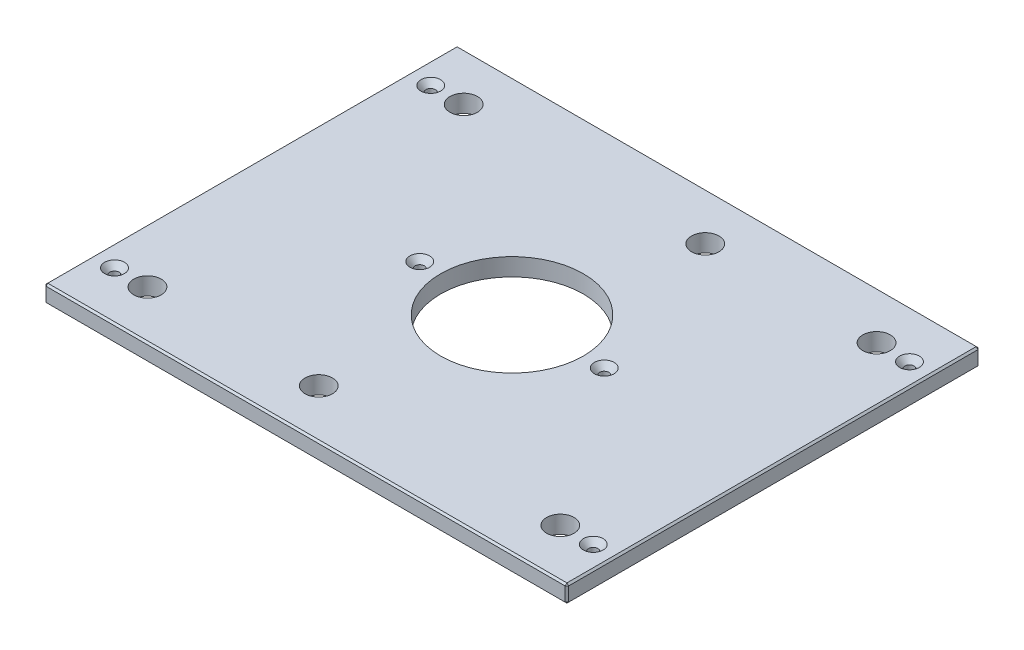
ISO-10303-21;
HEADER;
FILE_DESCRIPTION(('STEP AP214'),'2;1');
FILE_NAME('part.step','',(''),(''),'','','');
FILE_SCHEMA(('AUTOMOTIVE_DESIGN { 1 0 10303 214 1 1 1 1 }'));
ENDSEC;
DATA;
#1=APPLICATION_CONTEXT('core data for automotive mechanical design processes');
#2=APPLICATION_PROTOCOL_DEFINITION('international standard','automotive_design',2000,#1);
#3=PRODUCT_CONTEXT('',#1,'mechanical');
#4=PRODUCT('Part','Part','',(#3));
#5=PRODUCT_RELATED_PRODUCT_CATEGORY('part','',(#4));
#6=PRODUCT_DEFINITION_FORMATION('','',#4);
#7=PRODUCT_DEFINITION_CONTEXT('part definition',#1,'design');
#8=PRODUCT_DEFINITION('design','',#6,#7);
#9=PRODUCT_DEFINITION_SHAPE('','',#8);
#10=(LENGTH_UNIT() NAMED_UNIT(*) SI_UNIT(.MILLI.,.METRE.));
#11=(NAMED_UNIT(*) PLANE_ANGLE_UNIT() SI_UNIT($,.RADIAN.));
#12=(NAMED_UNIT(*) SI_UNIT($,.STERADIAN.) SOLID_ANGLE_UNIT());
#13=UNCERTAINTY_MEASURE_WITH_UNIT(LENGTH_MEASURE(1.E-05),#10,'distance_accuracy_value','');
#14=(GEOMETRIC_REPRESENTATION_CONTEXT(3) GLOBAL_UNCERTAINTY_ASSIGNED_CONTEXT((#13)) GLOBAL_UNIT_ASSIGNED_CONTEXT((#10,
#11,#12)) REPRESENTATION_CONTEXT('',''));
#15=CARTESIAN_POINT('',(0.,0.,0.));
#16=DIRECTION('',(0.,0.,1.));
#17=DIRECTION('',(1.,0.,0.));
#18=AXIS2_PLACEMENT_3D('',#15,#16,#17);
#19=CARTESIAN_POINT('',(-188.9125,12.7,-149.225));
#20=DIRECTION('',(1.,0.,0.));
#21=DIRECTION('',(0.,0.,-1.));
#22=AXIS2_PLACEMENT_3D('',#19,#20,#21);
#23=PLANE('',#22);
#24=DIRECTION('',(0.,0.,-1.));
#25=VECTOR('',#24,1.);
#26=CARTESIAN_POINT('',(-188.9125,11.4299999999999,-149.225));
#27=LINE('',#26,#25);
#28=CARTESIAN_POINT('',(-188.9125,11.4299999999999,147.955));
#29=VERTEX_POINT('',#28);
#30=CARTESIAN_POINT('',(-188.9125,11.4299999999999,-147.955));
#31=VERTEX_POINT('',#30);
#32=EDGE_CURVE('E135',#29,#31,#27,.T.);
#33=ORIENTED_EDGE('',*,*,#32,.T.);
#34=DIRECTION('',(0.,-1.,0.));
#35=VECTOR('',#34,1.);
#36=CARTESIAN_POINT('',(-188.9125,12.7,-147.955));
#37=LINE('',#36,#35);
#38=CARTESIAN_POINT('',(-188.9125,1.27000000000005,-147.955));
#39=VERTEX_POINT('',#38);
#40=EDGE_CURVE('E131',#31,#39,#37,.T.);
#41=ORIENTED_EDGE('',*,*,#40,.T.);
#42=DIRECTION('',(0.,0.,1.));
#43=VECTOR('',#42,1.);
#44=CARTESIAN_POINT('',(-188.9125,1.27000000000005,-149.225));
#45=LINE('',#44,#43);
#46=CARTESIAN_POINT('',(-188.9125,1.27000000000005,147.955));
#47=VERTEX_POINT('',#46);
#48=EDGE_CURVE('E126',#39,#47,#45,.T.);
#49=ORIENTED_EDGE('',*,*,#48,.T.);
#50=DIRECTION('',(0.,1.,0.));
#51=VECTOR('',#50,1.);
#52=CARTESIAN_POINT('',(-188.9125,12.7,147.955));
#53=LINE('',#52,#51);
#54=EDGE_CURVE('E128',#47,#29,#53,.T.);
#55=ORIENTED_EDGE('',*,*,#54,.T.);
#56=EDGE_LOOP('',(#33,#41,#49,#55));
#57=FACE_BOUND('',#56,.T.);
#58=ADVANCED_FACE('F35',(#57),#23,.F.);
#59=CARTESIAN_POINT('',(-188.9125,12.7,149.225));
#60=DIRECTION('',(0.,0.,-1.));
#61=DIRECTION('',(-1.,0.,0.));
#62=AXIS2_PLACEMENT_3D('',#59,#60,#61);
#63=PLANE('',#62);
#64=DIRECTION('',(1.,0.,0.));
#65=VECTOR('',#64,1.);
#66=CARTESIAN_POINT('',(-188.9125,1.27000000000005,149.225));
#67=LINE('',#66,#65);
#68=CARTESIAN_POINT('',(-187.6425,1.27000000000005,149.225));
#69=VERTEX_POINT('',#68);
#70=CARTESIAN_POINT('',(187.6425,1.27000000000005,149.225));
#71=VERTEX_POINT('',#70);
#72=EDGE_CURVE('E58',#69,#71,#67,.T.);
#73=ORIENTED_EDGE('',*,*,#72,.T.);
#74=DIRECTION('',(0.,1.,0.));
#75=VECTOR('',#74,1.);
#76=CARTESIAN_POINT('',(187.6425,12.7,149.225));
#77=LINE('',#76,#75);
#78=CARTESIAN_POINT('',(187.6425,11.4299999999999,149.225));
#79=VERTEX_POINT('',#78);
#80=EDGE_CURVE('E11',#71,#79,#77,.T.);
#81=ORIENTED_EDGE('',*,*,#80,.T.);
#82=DIRECTION('',(-1.,0.,0.));
#83=VECTOR('',#82,1.);
#84=CARTESIAN_POINT('',(-188.9125,11.4299999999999,149.225));
#85=LINE('',#84,#83);
#86=CARTESIAN_POINT('',(-187.6425,11.4299999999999,149.225));
#87=VERTEX_POINT('',#86);
#88=EDGE_CURVE('E44',#79,#87,#85,.T.);
#89=ORIENTED_EDGE('',*,*,#88,.T.);
#90=DIRECTION('',(0.,-1.,0.));
#91=VECTOR('',#90,1.);
#92=CARTESIAN_POINT('',(-187.6425,12.7,149.225));
#93=LINE('',#92,#91);
#94=EDGE_CURVE('E291',#87,#69,#93,.T.);
#95=ORIENTED_EDGE('',*,*,#94,.T.);
#96=EDGE_LOOP('',(#73,#81,#89,#95));
#97=FACE_BOUND('',#96,.T.);
#98=ADVANCED_FACE('F360',(#97),#63,.F.);
#99=CARTESIAN_POINT('',(188.9125,12.7,-149.225));
#100=DIRECTION('',(-1.,0.,0.));
#101=DIRECTION('',(0.,0.,1.));
#102=AXIS2_PLACEMENT_3D('',#99,#100,#101);
#103=PLANE('',#102);
#104=DIRECTION('',(0.,0.,-1.));
#105=VECTOR('',#104,1.);
#106=CARTESIAN_POINT('',(188.9125,1.27000000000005,-149.225));
#107=LINE('',#106,#105);
#108=CARTESIAN_POINT('',(188.9125,1.27000000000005,147.955));
#109=VERTEX_POINT('',#108);
#110=CARTESIAN_POINT('',(188.9125,1.27000000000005,-147.955));
#111=VERTEX_POINT('',#110);
#112=EDGE_CURVE('E286',#109,#111,#107,.T.);
#113=ORIENTED_EDGE('',*,*,#112,.T.);
#114=DIRECTION('',(0.,1.,0.));
#115=VECTOR('',#114,1.);
#116=CARTESIAN_POINT('',(188.9125,12.7,-147.955));
#117=LINE('',#116,#115);
#118=CARTESIAN_POINT('',(188.9125,11.4299999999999,-147.955));
#119=VERTEX_POINT('',#118);
#120=EDGE_CURVE('E288',#111,#119,#117,.T.);
#121=ORIENTED_EDGE('',*,*,#120,.T.);
#122=DIRECTION('',(0.,0.,1.));
#123=VECTOR('',#122,1.);
#124=CARTESIAN_POINT('',(188.9125,11.4299999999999,149.225));
#125=LINE('',#124,#123);
#126=CARTESIAN_POINT('',(188.9125,11.4299999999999,147.955));
#127=VERTEX_POINT('',#126);
#128=EDGE_CURVE('E284',#119,#127,#125,.T.);
#129=ORIENTED_EDGE('',*,*,#128,.T.);
#130=DIRECTION('',(0.,-1.,0.));
#131=VECTOR('',#130,1.);
#132=CARTESIAN_POINT('',(188.9125,12.7,147.955));
#133=LINE('',#132,#131);
#134=EDGE_CURVE('E282',#127,#109,#133,.T.);
#135=ORIENTED_EDGE('',*,*,#134,.T.);
#136=EDGE_LOOP('',(#113,#121,#129,#135));
#137=FACE_BOUND('',#136,.T.);
#138=ADVANCED_FACE('F347',(#137),#103,.F.);
#139=CARTESIAN_POINT('',(-188.9125,12.7,-149.225));
#140=DIRECTION('',(0.,0.,1.));
#141=DIRECTION('',(1.,0.,0.));
#142=AXIS2_PLACEMENT_3D('',#139,#140,#141);
#143=PLANE('',#142);
#144=DIRECTION('',(-1.,0.,0.));
#145=VECTOR('',#144,1.);
#146=CARTESIAN_POINT('',(-188.9125,1.27000000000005,-149.225));
#147=LINE('',#146,#145);
#148=CARTESIAN_POINT('',(187.6425,1.27000000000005,-149.225));
#149=VERTEX_POINT('',#148);
#150=CARTESIAN_POINT('',(-187.6425,1.27000000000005,-149.225));
#151=VERTEX_POINT('',#150);
#152=EDGE_CURVE('E258',#149,#151,#147,.T.);
#153=ORIENTED_EDGE('',*,*,#152,.T.);
#154=DIRECTION('',(0.,1.,0.));
#155=VECTOR('',#154,1.);
#156=CARTESIAN_POINT('',(-187.6425,12.7,-149.225));
#157=LINE('',#156,#155);
#158=CARTESIAN_POINT('',(-187.6425,11.4299999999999,-149.225));
#159=VERTEX_POINT('',#158);
#160=EDGE_CURVE('E262',#151,#159,#157,.T.);
#161=ORIENTED_EDGE('',*,*,#160,.T.);
#162=DIRECTION('',(1.,0.,0.));
#163=VECTOR('',#162,1.);
#164=CARTESIAN_POINT('',(188.9125,11.4299999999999,-149.225));
#165=LINE('',#164,#163);
#166=CARTESIAN_POINT('',(187.6425,11.4299999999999,-149.225));
#167=VERTEX_POINT('',#166);
#168=EDGE_CURVE('E260',#159,#167,#165,.T.);
#169=ORIENTED_EDGE('',*,*,#168,.T.);
#170=DIRECTION('',(0.,-1.,0.));
#171=VECTOR('',#170,1.);
#172=CARTESIAN_POINT('',(187.6425,12.7,-149.225));
#173=LINE('',#172,#171);
#174=EDGE_CURVE('E256',#167,#149,#173,.T.);
#175=ORIENTED_EDGE('',*,*,#174,.T.);
#176=EDGE_LOOP('',(#153,#161,#169,#175));
#177=FACE_BOUND('',#176,.T.);
#178=ADVANCED_FACE('F321',(#177),#143,.F.);
#179=CARTESIAN_POINT('',(0.,12.7,0.));
#180=DIRECTION('',(0.,1.,0.));
#181=DIRECTION('',(0.,0.,1.));
#182=AXIS2_PLACEMENT_3D('',#179,#180,#181);
#183=PLANE('',#182);
#184=CARTESIAN_POINT('',(173.0375,12.7,-114.3));
#185=DIRECTION('',(0.,1.,0.));
#186=DIRECTION('',(0.,0.,1.));
#187=AXIS2_PLACEMENT_3D('',#184,#185,#186);
#188=CIRCLE('',#187,7.13739999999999);
#189=CARTESIAN_POINT('',(173.0375,12.7,-107.1626));
#190=VERTEX_POINT('',#189);
#191=EDGE_CURVE('E784',#190,#190,#188,.T.);
#192=ORIENTED_EDGE('',*,*,#191,.F.);
#193=EDGE_LOOP('',(#192));
#194=FACE_BOUND('',#193,.T.);
#195=CARTESIAN_POINT('',(173.0375,12.7,114.3));
#196=DIRECTION('',(0.,1.,0.));
#197=DIRECTION('',(0.,0.,1.));
#198=AXIS2_PLACEMENT_3D('',#195,#196,#197);
#199=CIRCLE('',#198,7.13739999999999);
#200=CARTESIAN_POINT('',(173.0375,12.7,121.4374));
#201=VERTEX_POINT('',#200);
#202=EDGE_CURVE('E788',#201,#201,#199,.T.);
#203=ORIENTED_EDGE('',*,*,#202,.F.);
#204=EDGE_LOOP('',(#203));
#205=FACE_BOUND('',#204,.T.);
#206=CARTESIAN_POINT('',(-173.0375,12.7,114.3));
#207=DIRECTION('',(0.,1.,0.));
#208=DIRECTION('',(0.,0.,1.));
#209=AXIS2_PLACEMENT_3D('',#206,#207,#208);
#210=CIRCLE('',#209,7.13739999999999);
#211=CARTESIAN_POINT('',(-173.0375,12.7,121.4374));
#212=VERTEX_POINT('',#211);
#213=EDGE_CURVE('E792',#212,#212,#210,.T.);
#214=ORIENTED_EDGE('',*,*,#213,.F.);
#215=EDGE_LOOP('',(#214));
#216=FACE_BOUND('',#215,.T.);
#217=CARTESIAN_POINT('',(-66.675,12.7,0.));
#218=DIRECTION('',(0.,1.,0.));
#219=DIRECTION('',(0.,0.,1.));
#220=AXIS2_PLACEMENT_3D('',#217,#218,#219);
#221=CIRCLE('',#220,7.1374);
#222=CARTESIAN_POINT('',(-66.675,12.7,7.1374));
#223=VERTEX_POINT('',#222);
#224=EDGE_CURVE('E796',#223,#223,#221,.T.);
#225=ORIENTED_EDGE('',*,*,#224,.F.);
#226=EDGE_LOOP('',(#225));
#227=FACE_BOUND('',#226,.T.);
#228=CARTESIAN_POINT('',(66.675,12.7,0.));
#229=DIRECTION('',(0.,1.,0.));
#230=DIRECTION('',(0.,0.,1.));
#231=AXIS2_PLACEMENT_3D('',#228,#229,#230);
#232=CIRCLE('',#231,7.1374);
#233=CARTESIAN_POINT('',(66.675,12.7,7.1374));
#234=VERTEX_POINT('',#233);
#235=EDGE_CURVE('E800',#234,#234,#232,.T.);
#236=ORIENTED_EDGE('',*,*,#235,.F.);
#237=EDGE_LOOP('',(#236));
#238=FACE_BOUND('',#237,.T.);
#239=CARTESIAN_POINT('',(-173.0375,12.7,-114.3));
#240=DIRECTION('',(0.,1.,0.));
#241=DIRECTION('',(0.,0.,1.));
#242=AXIS2_PLACEMENT_3D('',#239,#240,#241);
#243=CIRCLE('',#242,7.13739999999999);
#244=CARTESIAN_POINT('',(-173.0375,12.7,-107.1626));
#245=VERTEX_POINT('',#244);
#246=EDGE_CURVE('E803',#245,#245,#243,.T.);
#247=ORIENTED_EDGE('',*,*,#246,.F.);
#248=EDGE_LOOP('',(#247));
#249=FACE_BOUND('',#248,.T.);
#250=DIRECTION('',(0.,0.,-1.));
#251=VECTOR('',#250,1.);
#252=CARTESIAN_POINT('',(187.6425,12.7,-149.225));
#253=LINE('',#252,#251);
#254=CARTESIAN_POINT('',(187.6425,12.7,147.955));
#255=VERTEX_POINT('',#254);
#256=CARTESIAN_POINT('',(187.6425,12.7,-147.955));
#257=VERTEX_POINT('',#256);
#258=EDGE_CURVE('E269',#255,#257,#253,.T.);
#259=ORIENTED_EDGE('',*,*,#258,.T.);
#260=DIRECTION('',(-1.,0.,0.));
#261=VECTOR('',#260,1.);
#262=CARTESIAN_POINT('',(-188.9125,12.7,-147.955));
#263=LINE('',#262,#261);
#264=CARTESIAN_POINT('',(-187.6425,12.7,-147.955));
#265=VERTEX_POINT('',#264);
#266=EDGE_CURVE('E271',#257,#265,#263,.T.);
#267=ORIENTED_EDGE('',*,*,#266,.T.);
#268=DIRECTION('',(0.,0.,1.));
#269=VECTOR('',#268,1.);
#270=CARTESIAN_POINT('',(-187.6425,12.7,149.225));
#271=LINE('',#270,#269);
#272=CARTESIAN_POINT('',(-187.6425,12.7,147.955));
#273=VERTEX_POINT('',#272);
#274=EDGE_CURVE('E267',#265,#273,#271,.T.);
#275=ORIENTED_EDGE('',*,*,#274,.T.);
#276=DIRECTION('',(1.,0.,0.));
#277=VECTOR('',#276,1.);
#278=CARTESIAN_POINT('',(188.9125,12.7,147.955));
#279=LINE('',#278,#277);
#280=EDGE_CURVE('E265',#273,#255,#279,.T.);
#281=ORIENTED_EDGE('',*,*,#280,.T.);
#282=EDGE_LOOP('',(#259,#267,#275,#281));
#283=FACE_BOUND('',#282,.T.);
#284=CARTESIAN_POINT('',(149.225,12.7,-114.3));
#285=DIRECTION('',(0.,1.,0.));
#286=DIRECTION('',(0.,0.,1.));
#287=AXIS2_PLACEMENT_3D('',#284,#285,#286);
#288=CIRCLE('',#287,9.921875);
#289=CARTESIAN_POINT('',(149.225,12.7,-104.378125));
#290=VERTEX_POINT('',#289);
#291=EDGE_CURVE('E204',#290,#290,#288,.T.);
#292=ORIENTED_EDGE('',*,*,#291,.F.);
#293=EDGE_LOOP('',(#292));
#294=FACE_BOUND('',#293,.T.);
#295=CARTESIAN_POINT('',(-149.225,12.7,-114.3));
#296=DIRECTION('',(0.,1.,0.));
#297=DIRECTION('',(0.,0.,1.));
#298=AXIS2_PLACEMENT_3D('',#295,#296,#297);
#299=CIRCLE('',#298,9.921875);
#300=CARTESIAN_POINT('',(-149.225,12.7,-104.378125));
#301=VERTEX_POINT('',#300);
#302=EDGE_CURVE('E214',#301,#301,#299,.T.);
#303=ORIENTED_EDGE('',*,*,#302,.F.);
#304=EDGE_LOOP('',(#303));
#305=FACE_BOUND('',#304,.T.);
#306=CARTESIAN_POINT('',(149.225,12.7,114.3));
#307=DIRECTION('',(0.,1.,0.));
#308=DIRECTION('',(0.,0.,1.));
#309=AXIS2_PLACEMENT_3D('',#306,#307,#308);
#310=CIRCLE('',#309,9.921875);
#311=CARTESIAN_POINT('',(149.225,12.7,124.221875));
#312=VERTEX_POINT('',#311);
#313=EDGE_CURVE('E225',#312,#312,#310,.T.);
#314=ORIENTED_EDGE('',*,*,#313,.F.);
#315=EDGE_LOOP('',(#314));
#316=FACE_BOUND('',#315,.T.);
#317=CARTESIAN_POINT('',(-149.225,12.7,114.3));
#318=DIRECTION('',(0.,1.,0.));
#319=DIRECTION('',(0.,0.,1.));
#320=AXIS2_PLACEMENT_3D('',#317,#318,#319);
#321=CIRCLE('',#320,9.921875);
#322=CARTESIAN_POINT('',(-149.225,12.7,124.221875));
#323=VERTEX_POINT('',#322);
#324=EDGE_CURVE('E231',#323,#323,#321,.T.);
#325=ORIENTED_EDGE('',*,*,#324,.F.);
#326=EDGE_LOOP('',(#325));
#327=FACE_BOUND('',#326,.T.);
#328=CARTESIAN_POINT('',(25.4,12.7,-114.3));
#329=DIRECTION('',(0.,1.,0.));
#330=DIRECTION('',(0.,0.,1.));
#331=AXIS2_PLACEMENT_3D('',#328,#329,#330);
#332=CIRCLE('',#331,9.921875);
#333=CARTESIAN_POINT('',(25.4,12.7,-104.378125));
#334=VERTEX_POINT('',#333);
#335=EDGE_CURVE('E237',#334,#334,#332,.T.);
#336=ORIENTED_EDGE('',*,*,#335,.F.);
#337=EDGE_LOOP('',(#336));
#338=FACE_BOUND('',#337,.T.);
#339=CARTESIAN_POINT('',(-25.4,12.7,114.3));
#340=DIRECTION('',(0.,1.,0.));
#341=DIRECTION('',(0.,0.,1.));
#342=AXIS2_PLACEMENT_3D('',#339,#340,#341);
#343=CIRCLE('',#342,9.921875);
#344=CARTESIAN_POINT('',(-25.4,12.7,124.221875));
#345=VERTEX_POINT('',#344);
#346=EDGE_CURVE('E243',#345,#345,#343,.T.);
#347=ORIENTED_EDGE('',*,*,#346,.F.);
#348=EDGE_LOOP('',(#347));
#349=FACE_BOUND('',#348,.T.);
#350=CARTESIAN_POINT('',(0.,12.7,0.));
#351=DIRECTION('',(0.,1.,0.));
#352=DIRECTION('',(0.,0.,1.));
#353=AXIS2_PLACEMENT_3D('',#350,#351,#352);
#354=CIRCLE('',#353,51.562);
#355=CARTESIAN_POINT('',(0.,12.7,51.562));
#356=VERTEX_POINT('',#355);
#357=EDGE_CURVE('E249',#356,#356,#354,.T.);
#358=ORIENTED_EDGE('',*,*,#357,.F.);
#359=EDGE_LOOP('',(#358));
#360=FACE_BOUND('',#359,.T.);
#361=ADVANCED_FACE('F369',(#194,#205,#216,#227,#238,#249,#283,#294,#305,#316,#327,#338,#349,
#360),#183,.T.);
#362=CARTESIAN_POINT('',(0.,0.,0.));
#363=DIRECTION('',(0.,1.,0.));
#364=DIRECTION('',(0.,0.,1.));
#365=AXIS2_PLACEMENT_3D('',#362,#363,#364);
#366=PLANE('',#365);
#367=CARTESIAN_POINT('',(173.0375,0.,-114.3));
#368=DIRECTION('',(0.,1.,0.));
#369=DIRECTION('',(0.,0.,1.));
#370=AXIS2_PLACEMENT_3D('',#367,#368,#369);
#371=CIRCLE('',#370,3.3782);
#372=CARTESIAN_POINT('',(173.0375,0.,-110.9218));
#373=VERTEX_POINT('',#372);
#374=EDGE_CURVE('E837',#373,#373,#371,.T.);
#375=ORIENTED_EDGE('',*,*,#374,.T.);
#376=EDGE_LOOP('',(#375));
#377=FACE_BOUND('',#376,.T.);
#378=CARTESIAN_POINT('',(173.0375,0.,114.3));
#379=DIRECTION('',(0.,1.,0.));
#380=DIRECTION('',(0.,0.,1.));
#381=AXIS2_PLACEMENT_3D('',#378,#379,#380);
#382=CIRCLE('',#381,3.3782);
#383=CARTESIAN_POINT('',(173.0375,0.,117.6782));
#384=VERTEX_POINT('',#383);
#385=EDGE_CURVE('E830',#384,#384,#382,.T.);
#386=ORIENTED_EDGE('',*,*,#385,.T.);
#387=EDGE_LOOP('',(#386));
#388=FACE_BOUND('',#387,.T.);
#389=CARTESIAN_POINT('',(-173.0375,0.,114.3));
#390=DIRECTION('',(0.,1.,0.));
#391=DIRECTION('',(0.,0.,1.));
#392=AXIS2_PLACEMENT_3D('',#389,#390,#391);
#393=CIRCLE('',#392,3.3782);
#394=CARTESIAN_POINT('',(-173.0375,0.,117.6782));
#395=VERTEX_POINT('',#394);
#396=EDGE_CURVE('E823',#395,#395,#393,.T.);
#397=ORIENTED_EDGE('',*,*,#396,.T.);
#398=EDGE_LOOP('',(#397));
#399=FACE_BOUND('',#398,.T.);
#400=CARTESIAN_POINT('',(-66.675,0.,0.));
#401=DIRECTION('',(0.,1.,0.));
#402=DIRECTION('',(0.,0.,1.));
#403=AXIS2_PLACEMENT_3D('',#400,#401,#402);
#404=CIRCLE('',#403,3.3782);
#405=CARTESIAN_POINT('',(-66.675,0.,3.3782));
#406=VERTEX_POINT('',#405);
#407=EDGE_CURVE('E816',#406,#406,#404,.T.);
#408=ORIENTED_EDGE('',*,*,#407,.T.);
#409=EDGE_LOOP('',(#408));
#410=FACE_BOUND('',#409,.T.);
#411=CARTESIAN_POINT('',(66.675,0.,0.));
#412=DIRECTION('',(0.,1.,0.));
#413=DIRECTION('',(0.,0.,1.));
#414=AXIS2_PLACEMENT_3D('',#411,#412,#413);
#415=CIRCLE('',#414,3.3782);
#416=CARTESIAN_POINT('',(66.675,0.,3.3782));
#417=VERTEX_POINT('',#416);
#418=EDGE_CURVE('E806',#417,#417,#415,.T.);
#419=ORIENTED_EDGE('',*,*,#418,.T.);
#420=EDGE_LOOP('',(#419));
#421=FACE_BOUND('',#420,.T.);
#422=CARTESIAN_POINT('',(-173.0375,0.,-114.3));
#423=DIRECTION('',(0.,1.,0.));
#424=DIRECTION('',(0.,0.,1.));
#425=AXIS2_PLACEMENT_3D('',#422,#423,#424);
#426=CIRCLE('',#425,3.3782);
#427=CARTESIAN_POINT('',(-173.0375,0.,-110.9218));
#428=VERTEX_POINT('',#427);
#429=EDGE_CURVE('E217',#428,#428,#426,.T.);
#430=ORIENTED_EDGE('',*,*,#429,.T.);
#431=EDGE_LOOP('',(#430));
#432=FACE_BOUND('',#431,.T.);
#433=DIRECTION('',(0.,0.,-1.));
#434=VECTOR('',#433,1.);
#435=CARTESIAN_POINT('',(-187.6425,0.,0.));
#436=LINE('',#435,#434);
#437=CARTESIAN_POINT('',(-187.6425,0.,147.955));
#438=VERTEX_POINT('',#437);
#439=CARTESIAN_POINT('',(-187.6425,0.,-147.955));
#440=VERTEX_POINT('',#439);
#441=EDGE_CURVE('E158',#438,#440,#436,.T.);
#442=ORIENTED_EDGE('',*,*,#441,.T.);
#443=DIRECTION('',(1.,0.,0.));
#444=VECTOR('',#443,1.);
#445=CARTESIAN_POINT('',(0.,0.,-147.955));
#446=LINE('',#445,#444);
#447=CARTESIAN_POINT('',(187.6425,0.,-147.955));
#448=VERTEX_POINT('',#447);
#449=EDGE_CURVE('E279',#440,#448,#446,.T.);
#450=ORIENTED_EDGE('',*,*,#449,.T.);
#451=DIRECTION('',(0.,0.,1.));
#452=VECTOR('',#451,1.);
#453=CARTESIAN_POINT('',(187.6425,0.,0.));
#454=LINE('',#453,#452);
#455=CARTESIAN_POINT('',(187.6425,0.,147.955));
#456=VERTEX_POINT('',#455);
#457=EDGE_CURVE('E277',#448,#456,#454,.T.);
#458=ORIENTED_EDGE('',*,*,#457,.T.);
#459=DIRECTION('',(-1.,0.,0.));
#460=VECTOR('',#459,1.);
#461=CARTESIAN_POINT('',(0.,0.,147.955));
#462=LINE('',#461,#460);
#463=EDGE_CURVE('E274',#456,#438,#462,.T.);
#464=ORIENTED_EDGE('',*,*,#463,.T.);
#465=EDGE_LOOP('',(#442,#450,#458,#464));
#466=FACE_BOUND('',#465,.T.);
#467=CARTESIAN_POINT('',(149.225,0.,-114.3));
#468=DIRECTION('',(0.,1.,0.));
#469=DIRECTION('',(0.,0.,1.));
#470=AXIS2_PLACEMENT_3D('',#467,#468,#469);
#471=CIRCLE('',#470,9.921875);
#472=CARTESIAN_POINT('',(149.225,0.,-104.378125));
#473=VERTEX_POINT('',#472);
#474=EDGE_CURVE('E209',#473,#473,#471,.T.);
#475=ORIENTED_EDGE('',*,*,#474,.T.);
#476=EDGE_LOOP('',(#475));
#477=FACE_BOUND('',#476,.T.);
#478=CARTESIAN_POINT('',(-149.225,0.,-114.3));
#479=DIRECTION('',(0.,1.,0.));
#480=DIRECTION('',(0.,0.,1.));
#481=AXIS2_PLACEMENT_3D('',#478,#479,#480);
#482=CIRCLE('',#481,9.921875);
#483=CARTESIAN_POINT('',(-149.225,0.,-104.378125));
#484=VERTEX_POINT('',#483);
#485=EDGE_CURVE('E222',#484,#484,#482,.T.);
#486=ORIENTED_EDGE('',*,*,#485,.T.);
#487=EDGE_LOOP('',(#486));
#488=FACE_BOUND('',#487,.T.);
#489=CARTESIAN_POINT('',(149.225,0.,114.3));
#490=DIRECTION('',(0.,1.,0.));
#491=DIRECTION('',(0.,0.,1.));
#492=AXIS2_PLACEMENT_3D('',#489,#490,#491);
#493=CIRCLE('',#492,9.921875);
#494=CARTESIAN_POINT('',(149.225,0.,124.221875));
#495=VERTEX_POINT('',#494);
#496=EDGE_CURVE('E228',#495,#495,#493,.T.);
#497=ORIENTED_EDGE('',*,*,#496,.T.);
#498=EDGE_LOOP('',(#497));
#499=FACE_BOUND('',#498,.T.);
#500=CARTESIAN_POINT('',(-149.225,0.,114.3));
#501=DIRECTION('',(0.,1.,0.));
#502=DIRECTION('',(0.,0.,1.));
#503=AXIS2_PLACEMENT_3D('',#500,#501,#502);
#504=CIRCLE('',#503,9.921875);
#505=CARTESIAN_POINT('',(-149.225,0.,124.221875));
#506=VERTEX_POINT('',#505);
#507=EDGE_CURVE('E234',#506,#506,#504,.T.);
#508=ORIENTED_EDGE('',*,*,#507,.T.);
#509=EDGE_LOOP('',(#508));
#510=FACE_BOUND('',#509,.T.);
#511=CARTESIAN_POINT('',(25.4,0.,-114.3));
#512=DIRECTION('',(0.,1.,0.));
#513=DIRECTION('',(0.,0.,1.));
#514=AXIS2_PLACEMENT_3D('',#511,#512,#513);
#515=CIRCLE('',#514,9.921875);
#516=CARTESIAN_POINT('',(25.4,0.,-104.378125));
#517=VERTEX_POINT('',#516);
#518=EDGE_CURVE('E240',#517,#517,#515,.T.);
#519=ORIENTED_EDGE('',*,*,#518,.T.);
#520=EDGE_LOOP('',(#519));
#521=FACE_BOUND('',#520,.T.);
#522=CARTESIAN_POINT('',(-25.4,0.,114.3));
#523=DIRECTION('',(0.,1.,0.));
#524=DIRECTION('',(0.,0.,1.));
#525=AXIS2_PLACEMENT_3D('',#522,#523,#524);
#526=CIRCLE('',#525,9.921875);
#527=CARTESIAN_POINT('',(-25.4,0.,124.221875));
#528=VERTEX_POINT('',#527);
#529=EDGE_CURVE('E246',#528,#528,#526,.T.);
#530=ORIENTED_EDGE('',*,*,#529,.T.);
#531=EDGE_LOOP('',(#530));
#532=FACE_BOUND('',#531,.T.);
#533=CARTESIAN_POINT('',(0.,0.,0.));
#534=DIRECTION('',(0.,1.,0.));
#535=DIRECTION('',(0.,0.,1.));
#536=AXIS2_PLACEMENT_3D('',#533,#534,#535);
#537=CIRCLE('',#536,51.562);
#538=CARTESIAN_POINT('',(0.,0.,51.562));
#539=VERTEX_POINT('',#538);
#540=EDGE_CURVE('E147',#539,#539,#537,.T.);
#541=ORIENTED_EDGE('',*,*,#540,.T.);
#542=EDGE_LOOP('',(#541));
#543=FACE_BOUND('',#542,.T.);
#544=ADVANCED_FACE('F334',(#377,#388,#399,#410,#421,#432,#466,#477,#488,#499,#510,#521,#532,
#543),#366,.F.);
#545=CARTESIAN_POINT('',(0.,0.,0.));
#546=DIRECTION('',(0.,1.,0.));
#547=DIRECTION('',(0.,0.,1.));
#548=AXIS2_PLACEMENT_3D('',#545,#546,#547);
#549=CYLINDRICAL_SURFACE('',#548,51.562);
#550=ORIENTED_EDGE('',*,*,#540,.F.);
#551=EDGE_LOOP('',(#550));
#552=FACE_BOUND('',#551,.T.);
#553=ORIENTED_EDGE('',*,*,#357,.T.);
#554=EDGE_LOOP('',(#553));
#555=FACE_BOUND('',#554,.T.);
#556=ADVANCED_FACE('F721',(#552,#555),#549,.F.);
#557=CARTESIAN_POINT('',(-25.4,12.7,114.3));
#558=DIRECTION('',(0.,1.,0.));
#559=DIRECTION('',(0.,0.,1.));
#560=AXIS2_PLACEMENT_3D('',#557,#558,#559);
#561=CYLINDRICAL_SURFACE('',#560,9.921875);
#562=ORIENTED_EDGE('',*,*,#529,.F.);
#563=EDGE_LOOP('',(#562));
#564=FACE_BOUND('',#563,.T.);
#565=ORIENTED_EDGE('',*,*,#346,.T.);
#566=EDGE_LOOP('',(#565));
#567=FACE_BOUND('',#566,.T.);
#568=ADVANCED_FACE('F712',(#564,#567),#561,.F.);
#569=CARTESIAN_POINT('',(25.4,12.7,-114.3));
#570=DIRECTION('',(0.,1.,0.));
#571=DIRECTION('',(0.,0.,1.));
#572=AXIS2_PLACEMENT_3D('',#569,#570,#571);
#573=CYLINDRICAL_SURFACE('',#572,9.921875);
#574=ORIENTED_EDGE('',*,*,#518,.F.);
#575=EDGE_LOOP('',(#574));
#576=FACE_BOUND('',#575,.T.);
#577=ORIENTED_EDGE('',*,*,#335,.T.);
#578=EDGE_LOOP('',(#577));
#579=FACE_BOUND('',#578,.T.);
#580=ADVANCED_FACE('F703',(#576,#579),#573,.F.);
#581=CARTESIAN_POINT('',(-149.225,12.7,114.3));
#582=DIRECTION('',(0.,1.,0.));
#583=DIRECTION('',(0.,0.,1.));
#584=AXIS2_PLACEMENT_3D('',#581,#582,#583);
#585=CYLINDRICAL_SURFACE('',#584,9.921875);
#586=ORIENTED_EDGE('',*,*,#507,.F.);
#587=EDGE_LOOP('',(#586));
#588=FACE_BOUND('',#587,.T.);
#589=ORIENTED_EDGE('',*,*,#324,.T.);
#590=EDGE_LOOP('',(#589));
#591=FACE_BOUND('',#590,.T.);
#592=ADVANCED_FACE('F694',(#588,#591),#585,.F.);
#593=CARTESIAN_POINT('',(149.225,12.7,114.3));
#594=DIRECTION('',(0.,1.,0.));
#595=DIRECTION('',(0.,0.,1.));
#596=AXIS2_PLACEMENT_3D('',#593,#594,#595);
#597=CYLINDRICAL_SURFACE('',#596,9.921875);
#598=ORIENTED_EDGE('',*,*,#496,.F.);
#599=EDGE_LOOP('',(#598));
#600=FACE_BOUND('',#599,.T.);
#601=ORIENTED_EDGE('',*,*,#313,.T.);
#602=EDGE_LOOP('',(#601));
#603=FACE_BOUND('',#602,.T.);
#604=ADVANCED_FACE('F685',(#600,#603),#597,.F.);
#605=CARTESIAN_POINT('',(-149.225,12.7,-114.3));
#606=DIRECTION('',(0.,1.,0.));
#607=DIRECTION('',(0.,0.,1.));
#608=AXIS2_PLACEMENT_3D('',#605,#606,#607);
#609=CYLINDRICAL_SURFACE('',#608,9.921875);
#610=ORIENTED_EDGE('',*,*,#485,.F.);
#611=EDGE_LOOP('',(#610));
#612=FACE_BOUND('',#611,.T.);
#613=ORIENTED_EDGE('',*,*,#302,.T.);
#614=EDGE_LOOP('',(#613));
#615=FACE_BOUND('',#614,.T.);
#616=ADVANCED_FACE('F675',(#612,#615),#609,.F.);
#617=CARTESIAN_POINT('',(149.225,12.7,-114.3));
#618=DIRECTION('',(0.,1.,0.));
#619=DIRECTION('',(0.,0.,1.));
#620=AXIS2_PLACEMENT_3D('',#617,#618,#619);
#621=CYLINDRICAL_SURFACE('',#620,9.921875);
#622=ORIENTED_EDGE('',*,*,#474,.F.);
#623=EDGE_LOOP('',(#622));
#624=FACE_BOUND('',#623,.T.);
#625=ORIENTED_EDGE('',*,*,#291,.T.);
#626=EDGE_LOOP('',(#625));
#627=FACE_BOUND('',#626,.T.);
#628=ADVANCED_FACE('F378',(#624,#627),#621,.F.);
#629=CARTESIAN_POINT('',(188.9125,12.7,147.955));
#630=DIRECTION('',(-0.707106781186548,0.,-0.707106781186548));
#631=DIRECTION('',(0.,-1.,0.));
#632=AXIS2_PLACEMENT_3D('',#629,#630,#631);
#633=PLANE('',#632);
#634=DIRECTION('',(-0.707106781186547,0.,0.707106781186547));
#635=VECTOR('',#634,1.);
#636=CARTESIAN_POINT('',(188.9125,11.4299999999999,147.955));
#637=LINE('',#636,#635);
#638=EDGE_CURVE('E39',#79,#127,#637,.F.);
#639=ORIENTED_EDGE('',*,*,#638,.F.);
#640=ORIENTED_EDGE('',*,*,#80,.F.);
#641=DIRECTION('',(0.707106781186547,0.,-0.707106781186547));
#642=VECTOR('',#641,1.);
#643=CARTESIAN_POINT('',(188.2775,1.27000000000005,148.59));
#644=LINE('',#643,#642);
#645=EDGE_CURVE('E197',#109,#71,#644,.F.);
#646=ORIENTED_EDGE('',*,*,#645,.F.);
#647=ORIENTED_EDGE('',*,*,#134,.F.);
#648=EDGE_LOOP('',(#639,#640,#646,#647));
#649=FACE_BOUND('',#648,.T.);
#650=ADVANCED_FACE('F37',(#649),#633,.F.);
#651=CARTESIAN_POINT('',(188.9125,11.4299999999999,147.955));
#652=DIRECTION('',(0.577350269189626,0.577350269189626,0.577350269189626));
#653=DIRECTION('',(0.707106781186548,0.,-0.707106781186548));
#654=AXIS2_PLACEMENT_3D('',#651,#652,#653);
#655=PLANE('',#654);
#656=DIRECTION('',(0.,-0.707106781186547,0.707106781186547));
#657=VECTOR('',#656,1.);
#658=CARTESIAN_POINT('',(187.6425,12.065,148.59));
#659=LINE('',#658,#657);
#660=EDGE_CURVE('E193',#79,#255,#659,.F.);
#661=ORIENTED_EDGE('',*,*,#660,.F.);
#662=ORIENTED_EDGE('',*,*,#638,.T.);
#663=DIRECTION('',(-0.707106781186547,0.707106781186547,0.));
#664=VECTOR('',#663,1.);
#665=CARTESIAN_POINT('',(188.9125,11.4299999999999,147.955));
#666=LINE('',#665,#664);
#667=EDGE_CURVE('E195',#255,#127,#666,.F.);
#668=ORIENTED_EDGE('',*,*,#667,.F.);
#669=EDGE_LOOP('',(#661,#662,#668));
#670=FACE_BOUND('',#669,.T.);
#671=ADVANCED_FACE('F371',(#670),#655,.T.);
#672=CARTESIAN_POINT('',(187.6425,0.,147.955));
#673=DIRECTION('',(0.577350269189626,-0.577350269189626,0.577350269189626));
#674=DIRECTION('',(0.707106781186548,0.,-0.707106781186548));
#675=AXIS2_PLACEMENT_3D('',#672,#673,#674);
#676=PLANE('',#675);
#677=DIRECTION('',(-0.707106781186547,-0.707106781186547,0.));
#678=VECTOR('',#677,1.);
#679=CARTESIAN_POINT('',(187.6425,0.,147.955));
#680=LINE('',#679,#678);
#681=EDGE_CURVE('E187',#109,#456,#680,.T.);
#682=ORIENTED_EDGE('',*,*,#681,.F.);
#683=ORIENTED_EDGE('',*,*,#645,.T.);
#684=DIRECTION('',(0.,0.707106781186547,0.707106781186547));
#685=VECTOR('',#684,1.);
#686=CARTESIAN_POINT('',(187.6425,0.,147.955));
#687=LINE('',#686,#685);
#688=EDGE_CURVE('E190',#456,#71,#687,.T.);
#689=ORIENTED_EDGE('',*,*,#688,.F.);
#690=EDGE_LOOP('',(#682,#683,#689));
#691=FACE_BOUND('',#690,.T.);
#692=ADVANCED_FACE('F340',(#691),#676,.T.);
#693=CARTESIAN_POINT('',(187.6425,12.7,0.));
#694=DIRECTION('',(0.707106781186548,0.707106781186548,0.));
#695=DIRECTION('',(0.,0.,1.));
#696=AXIS2_PLACEMENT_3D('',#693,#694,#695);
#697=PLANE('',#696);
#698=ORIENTED_EDGE('',*,*,#667,.T.);
#699=ORIENTED_EDGE('',*,*,#128,.F.);
#700=DIRECTION('',(0.707106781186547,-0.707106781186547,0.));
#701=VECTOR('',#700,1.);
#702=CARTESIAN_POINT('',(188.2775,12.065,-147.955));
#703=LINE('',#702,#701);
#704=EDGE_CURVE('E182',#257,#119,#703,.T.);
#705=ORIENTED_EDGE('',*,*,#704,.F.);
#706=ORIENTED_EDGE('',*,*,#258,.F.);
#707=EDGE_LOOP('',(#698,#699,#705,#706));
#708=FACE_BOUND('',#707,.T.);
#709=ADVANCED_FACE('F357',(#708),#697,.T.);
#710=CARTESIAN_POINT('',(0.,12.7,147.955));
#711=DIRECTION('',(0.,0.707106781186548,0.707106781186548));
#712=DIRECTION('',(-1.,0.,0.));
#713=AXIS2_PLACEMENT_3D('',#710,#711,#712);
#714=PLANE('',#713);
#715=ORIENTED_EDGE('',*,*,#660,.T.);
#716=ORIENTED_EDGE('',*,*,#280,.F.);
#717=DIRECTION('',(0.,0.707106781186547,-0.707106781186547));
#718=VECTOR('',#717,1.);
#719=CARTESIAN_POINT('',(-187.6425,12.7,147.955));
#720=LINE('',#719,#718);
#721=EDGE_CURVE('E179',#87,#273,#720,.T.);
#722=ORIENTED_EDGE('',*,*,#721,.F.);
#723=ORIENTED_EDGE('',*,*,#88,.F.);
#724=EDGE_LOOP('',(#715,#716,#722,#723));
#725=FACE_BOUND('',#724,.T.);
#726=ADVANCED_FACE('F362',(#725),#714,.T.);
#727=CARTESIAN_POINT('',(-187.6425,12.7,149.225));
#728=DIRECTION('',(0.707106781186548,0.,-0.707106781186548));
#729=DIRECTION('',(0.,-1.,0.));
#730=AXIS2_PLACEMENT_3D('',#727,#728,#729);
#731=PLANE('',#730);
#732=DIRECTION('',(0.707106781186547,0.,0.707106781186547));
#733=VECTOR('',#732,1.);
#734=CARTESIAN_POINT('',(-188.9125,1.27000000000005,147.955));
#735=LINE('',#734,#733);
#736=EDGE_CURVE('E142',#69,#47,#735,.F.);
#737=ORIENTED_EDGE('',*,*,#736,.F.);
#738=ORIENTED_EDGE('',*,*,#94,.F.);
#739=DIRECTION('',(-0.707106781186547,0.,-0.707106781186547));
#740=VECTOR('',#739,1.);
#741=CARTESIAN_POINT('',(-188.2775,11.4299999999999,148.59));
#742=LINE('',#741,#740);
#743=EDGE_CURVE('E145',#29,#87,#742,.F.);
#744=ORIENTED_EDGE('',*,*,#743,.F.);
#745=ORIENTED_EDGE('',*,*,#54,.F.);
#746=EDGE_LOOP('',(#737,#738,#744,#745));
#747=FACE_BOUND('',#746,.T.);
#748=ADVANCED_FACE('F140',(#747),#731,.F.);
#749=CARTESIAN_POINT('',(-188.9125,1.27000000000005,149.225));
#750=DIRECTION('',(0.,0.707106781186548,-0.707106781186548));
#751=DIRECTION('',(1.,0.,0.));
#752=AXIS2_PLACEMENT_3D('',#749,#750,#751);
#753=PLANE('',#752);
#754=ORIENTED_EDGE('',*,*,#688,.T.);
#755=ORIENTED_EDGE('',*,*,#72,.F.);
#756=DIRECTION('',(0.,-0.707106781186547,-0.707106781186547));
#757=VECTOR('',#756,1.);
#758=CARTESIAN_POINT('',(-187.6425,0.635000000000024,148.59));
#759=LINE('',#758,#757);
#760=EDGE_CURVE('E155',#438,#69,#759,.F.);
#761=ORIENTED_EDGE('',*,*,#760,.F.);
#762=ORIENTED_EDGE('',*,*,#463,.F.);
#763=EDGE_LOOP('',(#754,#755,#761,#762));
#764=FACE_BOUND('',#763,.T.);
#765=ADVANCED_FACE('F339',(#764),#753,.F.);
#766=CARTESIAN_POINT('',(188.9125,1.27000000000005,-149.225));
#767=DIRECTION('',(-0.707106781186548,0.707106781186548,0.));
#768=DIRECTION('',(0.,0.,-1.));
#769=AXIS2_PLACEMENT_3D('',#766,#767,#768);
#770=PLANE('',#769);
#771=ORIENTED_EDGE('',*,*,#681,.T.);
#772=ORIENTED_EDGE('',*,*,#457,.F.);
#773=DIRECTION('',(0.707106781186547,0.707106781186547,0.));
#774=VECTOR('',#773,1.);
#775=CARTESIAN_POINT('',(187.6425,0.,-147.955));
#776=LINE('',#775,#774);
#777=EDGE_CURVE('E174',#111,#448,#776,.F.);
#778=ORIENTED_EDGE('',*,*,#777,.F.);
#779=ORIENTED_EDGE('',*,*,#112,.F.);
#780=EDGE_LOOP('',(#771,#772,#778,#779));
#781=FACE_BOUND('',#780,.T.);
#782=ADVANCED_FACE('F344',(#781),#770,.F.);
#783=CARTESIAN_POINT('',(187.6425,12.7,-149.225));
#784=DIRECTION('',(-0.707106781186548,0.,0.707106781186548));
#785=DIRECTION('',(0.,-1.,0.));
#786=AXIS2_PLACEMENT_3D('',#783,#784,#785);
#787=PLANE('',#786);
#788=DIRECTION('',(0.707106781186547,0.,0.707106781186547));
#789=VECTOR('',#788,1.);
#790=CARTESIAN_POINT('',(187.6425,11.4299999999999,-149.225));
#791=LINE('',#790,#789);
#792=EDGE_CURVE('E184',#119,#167,#791,.F.);
#793=ORIENTED_EDGE('',*,*,#792,.F.);
#794=ORIENTED_EDGE('',*,*,#120,.F.);
#795=DIRECTION('',(-0.707106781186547,0.,-0.707106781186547));
#796=VECTOR('',#795,1.);
#797=CARTESIAN_POINT('',(188.2775,1.27000000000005,-148.59));
#798=LINE('',#797,#796);
#799=EDGE_CURVE('E171',#149,#111,#798,.F.);
#800=ORIENTED_EDGE('',*,*,#799,.F.);
#801=ORIENTED_EDGE('',*,*,#174,.F.);
#802=EDGE_LOOP('',(#793,#794,#800,#801));
#803=FACE_BOUND('',#802,.T.);
#804=ADVANCED_FACE('F352',(#803),#787,.F.);
#805=CARTESIAN_POINT('',(187.6425,11.4299999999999,-149.225));
#806=DIRECTION('',(0.577350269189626,0.577350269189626,-0.577350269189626));
#807=DIRECTION('',(-0.707106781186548,0.,-0.707106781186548));
#808=AXIS2_PLACEMENT_3D('',#805,#806,#807);
#809=PLANE('',#808);
#810=ORIENTED_EDGE('',*,*,#704,.T.);
#811=ORIENTED_EDGE('',*,*,#792,.T.);
#812=DIRECTION('',(0.,0.707106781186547,0.707106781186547));
#813=VECTOR('',#812,1.);
#814=CARTESIAN_POINT('',(187.6425,11.4299999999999,-149.225));
#815=LINE('',#814,#813);
#816=EDGE_CURVE('E163',#257,#167,#815,.F.);
#817=ORIENTED_EDGE('',*,*,#816,.F.);
#818=EDGE_LOOP('',(#810,#811,#817));
#819=FACE_BOUND('',#818,.T.);
#820=ADVANCED_FACE('F410',(#819),#809,.T.);
#821=CARTESIAN_POINT('',(-187.6425,12.7,147.955));
#822=DIRECTION('',(-0.577350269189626,0.577350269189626,0.577350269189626));
#823=DIRECTION('',(0.707106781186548,0.,0.707106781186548));
#824=AXIS2_PLACEMENT_3D('',#821,#822,#823);
#825=PLANE('',#824);
#826=ORIENTED_EDGE('',*,*,#743,.T.);
#827=ORIENTED_EDGE('',*,*,#721,.T.);
#828=DIRECTION('',(-0.707106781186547,-0.707106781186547,0.));
#829=VECTOR('',#828,1.);
#830=CARTESIAN_POINT('',(-187.6425,12.7,147.955));
#831=LINE('',#830,#829);
#832=EDGE_CURVE('E159',#29,#273,#831,.F.);
#833=ORIENTED_EDGE('',*,*,#832,.F.);
#834=EDGE_LOOP('',(#826,#827,#833));
#835=FACE_BOUND('',#834,.T.);
#836=ADVANCED_FACE('F364',(#835),#825,.T.);
#837=CARTESIAN_POINT('',(-188.9125,1.27000000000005,147.955));
#838=DIRECTION('',(-0.577350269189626,-0.577350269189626,0.577350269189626));
#839=DIRECTION('',(0.707106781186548,0.,0.707106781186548));
#840=AXIS2_PLACEMENT_3D('',#837,#838,#839);
#841=PLANE('',#840);
#842=ORIENTED_EDGE('',*,*,#760,.T.);
#843=ORIENTED_EDGE('',*,*,#736,.T.);
#844=DIRECTION('',(-0.707106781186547,0.707106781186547,0.));
#845=VECTOR('',#844,1.);
#846=CARTESIAN_POINT('',(-188.9125,1.27000000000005,147.955));
#847=LINE('',#846,#845);
#848=EDGE_CURVE('E152',#438,#47,#847,.T.);
#849=ORIENTED_EDGE('',*,*,#848,.F.);
#850=EDGE_LOOP('',(#842,#843,#849));
#851=FACE_BOUND('',#850,.T.);
#852=ADVANCED_FACE('F151',(#851),#841,.T.);
#853=CARTESIAN_POINT('',(187.6425,0.,-147.955));
#854=DIRECTION('',(0.577350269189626,-0.577350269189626,-0.577350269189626));
#855=DIRECTION('',(-0.707106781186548,0.,-0.707106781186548));
#856=AXIS2_PLACEMENT_3D('',#853,#854,#855);
#857=PLANE('',#856);
#858=ORIENTED_EDGE('',*,*,#799,.T.);
#859=ORIENTED_EDGE('',*,*,#777,.T.);
#860=DIRECTION('',(0.,-0.707106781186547,0.707106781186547));
#861=VECTOR('',#860,1.);
#862=CARTESIAN_POINT('',(187.6425,0.,-147.955));
#863=LINE('',#862,#861);
#864=EDGE_CURVE('E160',#149,#448,#863,.T.);
#865=ORIENTED_EDGE('',*,*,#864,.F.);
#866=EDGE_LOOP('',(#858,#859,#865));
#867=FACE_BOUND('',#866,.T.);
#868=ADVANCED_FACE('F402',(#867),#857,.T.);
#869=CARTESIAN_POINT('',(0.,12.7,-147.955));
#870=DIRECTION('',(0.,0.707106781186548,-0.707106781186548));
#871=DIRECTION('',(1.,0.,0.));
#872=AXIS2_PLACEMENT_3D('',#869,#870,#871);
#873=PLANE('',#872);
#874=ORIENTED_EDGE('',*,*,#816,.T.);
#875=ORIENTED_EDGE('',*,*,#168,.F.);
#876=DIRECTION('',(0.,-0.707106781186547,-0.707106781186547));
#877=VECTOR('',#876,1.);
#878=CARTESIAN_POINT('',(-187.6425,11.4299999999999,-149.225));
#879=LINE('',#878,#877);
#880=EDGE_CURVE('E165',#265,#159,#879,.T.);
#881=ORIENTED_EDGE('',*,*,#880,.F.);
#882=ORIENTED_EDGE('',*,*,#266,.F.);
#883=EDGE_LOOP('',(#874,#875,#881,#882));
#884=FACE_BOUND('',#883,.T.);
#885=ADVANCED_FACE('F316',(#884),#873,.T.);
#886=CARTESIAN_POINT('',(-187.6425,12.7,0.));
#887=DIRECTION('',(-0.707106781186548,0.707106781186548,0.));
#888=DIRECTION('',(0.,0.,-1.));
#889=AXIS2_PLACEMENT_3D('',#886,#887,#888);
#890=PLANE('',#889);
#891=ORIENTED_EDGE('',*,*,#832,.T.);
#892=ORIENTED_EDGE('',*,*,#274,.F.);
#893=DIRECTION('',(0.707106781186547,0.707106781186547,0.));
#894=VECTOR('',#893,1.);
#895=CARTESIAN_POINT('',(-188.2775,12.065,-147.955));
#896=LINE('',#895,#894);
#897=EDGE_CURVE('E305',#31,#265,#896,.T.);
#898=ORIENTED_EDGE('',*,*,#897,.F.);
#899=ORIENTED_EDGE('',*,*,#32,.F.);
#900=EDGE_LOOP('',(#891,#892,#898,#899));
#901=FACE_BOUND('',#900,.T.);
#902=ADVANCED_FACE('F367',(#901),#890,.T.);
#903=CARTESIAN_POINT('',(-188.9125,1.27000000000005,-149.225));
#904=DIRECTION('',(0.707106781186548,0.707106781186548,0.));
#905=DIRECTION('',(0.,0.,1.));
#906=AXIS2_PLACEMENT_3D('',#903,#904,#905);
#907=PLANE('',#906);
#908=ORIENTED_EDGE('',*,*,#848,.T.);
#909=ORIENTED_EDGE('',*,*,#48,.F.);
#910=DIRECTION('',(0.707106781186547,-0.707106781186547,0.));
#911=VECTOR('',#910,1.);
#912=CARTESIAN_POINT('',(-188.9125,1.27000000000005,-147.955));
#913=LINE('',#912,#911);
#914=EDGE_CURVE('E302',#440,#39,#913,.F.);
#915=ORIENTED_EDGE('',*,*,#914,.F.);
#916=ORIENTED_EDGE('',*,*,#441,.F.);
#917=EDGE_LOOP('',(#908,#909,#915,#916));
#918=FACE_BOUND('',#917,.T.);
#919=ADVANCED_FACE('F157',(#918),#907,.F.);
#920=CARTESIAN_POINT('',(-188.9125,1.27000000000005,-149.225));
#921=DIRECTION('',(0.,0.707106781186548,0.707106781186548));
#922=DIRECTION('',(-1.,0.,0.));
#923=AXIS2_PLACEMENT_3D('',#920,#921,#922);
#924=PLANE('',#923);
#925=ORIENTED_EDGE('',*,*,#864,.T.);
#926=ORIENTED_EDGE('',*,*,#449,.F.);
#927=DIRECTION('',(0.,0.707106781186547,-0.707106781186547));
#928=VECTOR('',#927,1.);
#929=CARTESIAN_POINT('',(-187.6425,0.635000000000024,-148.59));
#930=LINE('',#929,#928);
#931=EDGE_CURVE('E299',#151,#440,#930,.F.);
#932=ORIENTED_EDGE('',*,*,#931,.F.);
#933=ORIENTED_EDGE('',*,*,#152,.F.);
#934=EDGE_LOOP('',(#925,#926,#932,#933));
#935=FACE_BOUND('',#934,.T.);
#936=ADVANCED_FACE('F331',(#935),#924,.F.);
#937=CARTESIAN_POINT('',(-187.6425,11.4299999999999,-149.225));
#938=DIRECTION('',(-0.577350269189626,0.577350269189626,-0.577350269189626));
#939=DIRECTION('',(-0.707106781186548,0.,0.707106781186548));
#940=AXIS2_PLACEMENT_3D('',#937,#938,#939);
#941=PLANE('',#940);
#942=ORIENTED_EDGE('',*,*,#897,.T.);
#943=ORIENTED_EDGE('',*,*,#880,.T.);
#944=DIRECTION('',(0.707106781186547,0.,-0.707106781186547));
#945=VECTOR('',#944,1.);
#946=CARTESIAN_POINT('',(-187.6425,11.4299999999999,-149.225));
#947=LINE('',#946,#945);
#948=EDGE_CURVE('E297',#31,#159,#947,.T.);
#949=ORIENTED_EDGE('',*,*,#948,.F.);
#950=EDGE_LOOP('',(#942,#943,#949));
#951=FACE_BOUND('',#950,.T.);
#952=ADVANCED_FACE('F311',(#951),#941,.T.);
#953=CARTESIAN_POINT('',(-188.9125,1.27000000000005,-147.955));
#954=DIRECTION('',(-0.577350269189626,-0.577350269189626,-0.577350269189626));
#955=DIRECTION('',(-0.707106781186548,0.,0.707106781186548));
#956=AXIS2_PLACEMENT_3D('',#953,#954,#955);
#957=PLANE('',#956);
#958=ORIENTED_EDGE('',*,*,#931,.T.);
#959=ORIENTED_EDGE('',*,*,#914,.T.);
#960=DIRECTION('',(-0.707106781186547,0.,0.707106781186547));
#961=VECTOR('',#960,1.);
#962=CARTESIAN_POINT('',(-188.9125,1.27000000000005,-147.955));
#963=LINE('',#962,#961);
#964=EDGE_CURVE('E295',#151,#39,#963,.T.);
#965=ORIENTED_EDGE('',*,*,#964,.F.);
#966=EDGE_LOOP('',(#958,#959,#965));
#967=FACE_BOUND('',#966,.T.);
#968=ADVANCED_FACE('F328',(#967),#957,.T.);
#969=CARTESIAN_POINT('',(-188.9125,12.7,-147.955));
#970=DIRECTION('',(0.707106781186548,0.,0.707106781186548));
#971=DIRECTION('',(0.,-1.,0.));
#972=AXIS2_PLACEMENT_3D('',#969,#970,#971);
#973=PLANE('',#972);
#974=ORIENTED_EDGE('',*,*,#948,.T.);
#975=ORIENTED_EDGE('',*,*,#160,.F.);
#976=ORIENTED_EDGE('',*,*,#964,.T.);
#977=ORIENTED_EDGE('',*,*,#40,.F.);
#978=EDGE_LOOP('',(#974,#975,#976,#977));
#979=FACE_BOUND('',#978,.T.);
#980=ADVANCED_FACE('F326',(#979),#973,.F.);
#981=CARTESIAN_POINT('',(-173.0375,12.7,-114.3));
#982=DIRECTION('',(0.,1.,0.));
#983=DIRECTION('',(0.,0.,1.));
#984=AXIS2_PLACEMENT_3D('',#981,#982,#983);
#985=CYLINDRICAL_SURFACE('',#984,3.3782);
#986=ORIENTED_EDGE('',*,*,#429,.F.);
#987=EDGE_LOOP('',(#986));
#988=FACE_BOUND('',#987,.T.);
#989=CARTESIAN_POINT('',(-173.0375,8.37553508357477,-114.3));
#990=DIRECTION('',(0.,1.,0.));
#991=DIRECTION('',(0.,0.,1.));
#992=AXIS2_PLACEMENT_3D('',#989,#990,#991);
#993=CIRCLE('',#992,3.3782);
#994=CARTESIAN_POINT('',(-173.0375,8.37553508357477,-110.9218));
#995=VERTEX_POINT('',#994);
#996=EDGE_CURVE('E805',#995,#995,#993,.T.);
#997=ORIENTED_EDGE('',*,*,#996,.T.);
#998=EDGE_LOOP('',(#997));
#999=FACE_BOUND('',#998,.T.);
#1000=ADVANCED_FACE('F389',(#988,#999),#985,.F.);
#1001=CARTESIAN_POINT('',(-173.0375,12.7,-114.3));
#1002=DIRECTION('',(0.,1.,0.));
#1003=DIRECTION('',(0.,0.,1.));
#1004=AXIS2_PLACEMENT_3D('',#1001,#1002,#1003);
#1005=CONICAL_SURFACE('',#1004,7.13739999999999,0.715584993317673);
#1006=ORIENTED_EDGE('',*,*,#996,.F.);
#1007=EDGE_LOOP('',(#1006));
#1008=FACE_BOUND('',#1007,.T.);
#1009=ORIENTED_EDGE('',*,*,#246,.T.);
#1010=EDGE_LOOP('',(#1009));
#1011=FACE_BOUND('',#1010,.T.);
#1012=ADVANCED_FACE('F499',(#1008,#1011),#1005,.F.);
#1013=CARTESIAN_POINT('',(66.675,12.7,0.));
#1014=DIRECTION('',(0.,1.,0.));
#1015=DIRECTION('',(0.,0.,1.));
#1016=AXIS2_PLACEMENT_3D('',#1013,#1014,#1015);
#1017=CYLINDRICAL_SURFACE('',#1016,3.3782);
#1018=ORIENTED_EDGE('',*,*,#418,.F.);
#1019=EDGE_LOOP('',(#1018));
#1020=FACE_BOUND('',#1019,.T.);
#1021=CARTESIAN_POINT('',(66.675,8.37553508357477,0.));
#1022=DIRECTION('',(0.,1.,0.));
#1023=DIRECTION('',(0.,0.,1.));
#1024=AXIS2_PLACEMENT_3D('',#1021,#1022,#1023);
#1025=CIRCLE('',#1024,3.3782);
#1026=CARTESIAN_POINT('',(66.675,8.37553508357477,3.3782));
#1027=VERTEX_POINT('',#1026);
#1028=EDGE_CURVE('E810',#1027,#1027,#1025,.T.);
#1029=ORIENTED_EDGE('',*,*,#1028,.T.);
#1030=EDGE_LOOP('',(#1029));
#1031=FACE_BOUND('',#1030,.T.);
#1032=ADVANCED_FACE('F508',(#1020,#1031),#1017,.F.);
#1033=CARTESIAN_POINT('',(66.675,12.7,0.));
#1034=DIRECTION('',(0.,1.,0.));
#1035=DIRECTION('',(0.,0.,1.));
#1036=AXIS2_PLACEMENT_3D('',#1033,#1034,#1035);
#1037=CONICAL_SURFACE('',#1036,7.1374,0.715584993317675);
#1038=ORIENTED_EDGE('',*,*,#1028,.F.);
#1039=EDGE_LOOP('',(#1038));
#1040=FACE_BOUND('',#1039,.T.);
#1041=ORIENTED_EDGE('',*,*,#235,.T.);
#1042=EDGE_LOOP('',(#1041));
#1043=FACE_BOUND('',#1042,.T.);
#1044=ADVANCED_FACE('F516',(#1040,#1043),#1037,.F.);
#1045=CARTESIAN_POINT('',(-66.675,12.7,0.));
#1046=DIRECTION('',(0.,1.,0.));
#1047=DIRECTION('',(0.,0.,1.));
#1048=AXIS2_PLACEMENT_3D('',#1045,#1046,#1047);
#1049=CYLINDRICAL_SURFACE('',#1048,3.3782);
#1050=ORIENTED_EDGE('',*,*,#407,.F.);
#1051=EDGE_LOOP('',(#1050));
#1052=FACE_BOUND('',#1051,.T.);
#1053=CARTESIAN_POINT('',(-66.675,8.37553508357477,0.));
#1054=DIRECTION('',(0.,1.,0.));
#1055=DIRECTION('',(0.,0.,1.));
#1056=AXIS2_PLACEMENT_3D('',#1053,#1054,#1055);
#1057=CIRCLE('',#1056,3.3782);
#1058=CARTESIAN_POINT('',(-66.675,8.37553508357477,3.3782));
#1059=VERTEX_POINT('',#1058);
#1060=EDGE_CURVE('E819',#1059,#1059,#1057,.T.);
#1061=ORIENTED_EDGE('',*,*,#1060,.T.);
#1062=EDGE_LOOP('',(#1061));
#1063=FACE_BOUND('',#1062,.T.);
#1064=ADVANCED_FACE('F524',(#1052,#1063),#1049,.F.);
#1065=CARTESIAN_POINT('',(-66.675,12.7,0.));
#1066=DIRECTION('',(0.,1.,0.));
#1067=DIRECTION('',(0.,0.,1.));
#1068=AXIS2_PLACEMENT_3D('',#1065,#1066,#1067);
#1069=CONICAL_SURFACE('',#1068,7.1374,0.715584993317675);
#1070=ORIENTED_EDGE('',*,*,#1060,.F.);
#1071=EDGE_LOOP('',(#1070));
#1072=FACE_BOUND('',#1071,.T.);
#1073=ORIENTED_EDGE('',*,*,#224,.T.);
#1074=EDGE_LOOP('',(#1073));
#1075=FACE_BOUND('',#1074,.T.);
#1076=ADVANCED_FACE('F532',(#1072,#1075),#1069,.F.);
#1077=CARTESIAN_POINT('',(-173.0375,12.7,114.3));
#1078=DIRECTION('',(0.,1.,0.));
#1079=DIRECTION('',(0.,0.,1.));
#1080=AXIS2_PLACEMENT_3D('',#1077,#1078,#1079);
#1081=CYLINDRICAL_SURFACE('',#1080,3.3782);
#1082=ORIENTED_EDGE('',*,*,#396,.F.);
#1083=EDGE_LOOP('',(#1082));
#1084=FACE_BOUND('',#1083,.T.);
#1085=CARTESIAN_POINT('',(-173.0375,8.37553508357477,114.3));
#1086=DIRECTION('',(0.,1.,0.));
#1087=DIRECTION('',(0.,0.,1.));
#1088=AXIS2_PLACEMENT_3D('',#1085,#1086,#1087);
#1089=CIRCLE('',#1088,3.3782);
#1090=CARTESIAN_POINT('',(-173.0375,8.37553508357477,117.6782));
#1091=VERTEX_POINT('',#1090);
#1092=EDGE_CURVE('E826',#1091,#1091,#1089,.T.);
#1093=ORIENTED_EDGE('',*,*,#1092,.T.);
#1094=EDGE_LOOP('',(#1093));
#1095=FACE_BOUND('',#1094,.T.);
#1096=ADVANCED_FACE('F540',(#1084,#1095),#1081,.F.);
#1097=CARTESIAN_POINT('',(-173.0375,12.7,114.3));
#1098=DIRECTION('',(0.,1.,0.));
#1099=DIRECTION('',(0.,0.,1.));
#1100=AXIS2_PLACEMENT_3D('',#1097,#1098,#1099);
#1101=CONICAL_SURFACE('',#1100,7.13739999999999,0.715584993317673);
#1102=ORIENTED_EDGE('',*,*,#1092,.F.);
#1103=EDGE_LOOP('',(#1102));
#1104=FACE_BOUND('',#1103,.T.);
#1105=ORIENTED_EDGE('',*,*,#213,.T.);
#1106=EDGE_LOOP('',(#1105));
#1107=FACE_BOUND('',#1106,.T.);
#1108=ADVANCED_FACE('F548',(#1104,#1107),#1101,.F.);
#1109=CARTESIAN_POINT('',(173.0375,12.7,114.3));
#1110=DIRECTION('',(0.,1.,0.));
#1111=DIRECTION('',(0.,0.,1.));
#1112=AXIS2_PLACEMENT_3D('',#1109,#1110,#1111);
#1113=CYLINDRICAL_SURFACE('',#1112,3.3782);
#1114=ORIENTED_EDGE('',*,*,#385,.F.);
#1115=EDGE_LOOP('',(#1114));
#1116=FACE_BOUND('',#1115,.T.);
#1117=CARTESIAN_POINT('',(173.0375,8.37553508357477,114.3));
#1118=DIRECTION('',(0.,1.,0.));
#1119=DIRECTION('',(0.,0.,1.));
#1120=AXIS2_PLACEMENT_3D('',#1117,#1118,#1119);
#1121=CIRCLE('',#1120,3.3782);
#1122=CARTESIAN_POINT('',(173.0375,8.37553508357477,117.6782));
#1123=VERTEX_POINT('',#1122);
#1124=EDGE_CURVE('E833',#1123,#1123,#1121,.T.);
#1125=ORIENTED_EDGE('',*,*,#1124,.T.);
#1126=EDGE_LOOP('',(#1125));
#1127=FACE_BOUND('',#1126,.T.);
#1128=ADVANCED_FACE('F556',(#1116,#1127),#1113,.F.);
#1129=CARTESIAN_POINT('',(173.0375,12.7,114.3));
#1130=DIRECTION('',(0.,1.,0.));
#1131=DIRECTION('',(0.,0.,1.));
#1132=AXIS2_PLACEMENT_3D('',#1129,#1130,#1131);
#1133=CONICAL_SURFACE('',#1132,7.13739999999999,0.715584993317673);
#1134=ORIENTED_EDGE('',*,*,#1124,.F.);
#1135=EDGE_LOOP('',(#1134));
#1136=FACE_BOUND('',#1135,.T.);
#1137=ORIENTED_EDGE('',*,*,#202,.T.);
#1138=EDGE_LOOP('',(#1137));
#1139=FACE_BOUND('',#1138,.T.);
#1140=ADVANCED_FACE('F564',(#1136,#1139),#1133,.F.);
#1141=CARTESIAN_POINT('',(173.0375,12.7,-114.3));
#1142=DIRECTION('',(0.,1.,0.));
#1143=DIRECTION('',(0.,0.,1.));
#1144=AXIS2_PLACEMENT_3D('',#1141,#1142,#1143);
#1145=CYLINDRICAL_SURFACE('',#1144,3.3782);
#1146=ORIENTED_EDGE('',*,*,#374,.F.);
#1147=EDGE_LOOP('',(#1146));
#1148=FACE_BOUND('',#1147,.T.);
#1149=CARTESIAN_POINT('',(173.0375,8.37553508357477,-114.3));
#1150=DIRECTION('',(0.,1.,0.));
#1151=DIRECTION('',(0.,0.,1.));
#1152=AXIS2_PLACEMENT_3D('',#1149,#1150,#1151);
#1153=CIRCLE('',#1152,3.3782);
#1154=CARTESIAN_POINT('',(173.0375,8.37553508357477,-110.9218));
#1155=VERTEX_POINT('',#1154);
#1156=EDGE_CURVE('E840',#1155,#1155,#1153,.T.);
#1157=ORIENTED_EDGE('',*,*,#1156,.T.);
#1158=EDGE_LOOP('',(#1157));
#1159=FACE_BOUND('',#1158,.T.);
#1160=ADVANCED_FACE('F572',(#1148,#1159),#1145,.F.);
#1161=CARTESIAN_POINT('',(173.0375,12.7,-114.3));
#1162=DIRECTION('',(0.,1.,0.));
#1163=DIRECTION('',(0.,0.,1.));
#1164=AXIS2_PLACEMENT_3D('',#1161,#1162,#1163);
#1165=CONICAL_SURFACE('',#1164,7.13739999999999,0.715584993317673);
#1166=ORIENTED_EDGE('',*,*,#1156,.F.);
#1167=EDGE_LOOP('',(#1166));
#1168=FACE_BOUND('',#1167,.T.);
#1169=ORIENTED_EDGE('',*,*,#191,.T.);
#1170=EDGE_LOOP('',(#1169));
#1171=FACE_BOUND('',#1170,.T.);
#1172=ADVANCED_FACE('F580',(#1168,#1171),#1165,.F.);
#1173=CLOSED_SHELL('',(#58,#98,#138,#178,#361,#544,#556,#568,#580,#592,#604,#616,#628,#650,#671,
#692,#709,#726,#748,#765,#782,#804,#820,#836,#852,#868,#885,#902,#919,#936,#952,#968,#980,#1000,
#1012,#1032,#1044,#1064,#1076,#1096,#1108,#1128,#1140,#1160,#1172));
#1174=MANIFOLD_SOLID_BREP('B2',#1173);
#1175=ADVANCED_BREP_SHAPE_REPRESENTATION('',(#18,#1174),#14);
#1176=SHAPE_DEFINITION_REPRESENTATION(#9,#1175);
ENDSEC;
END-ISO-10303-21;
